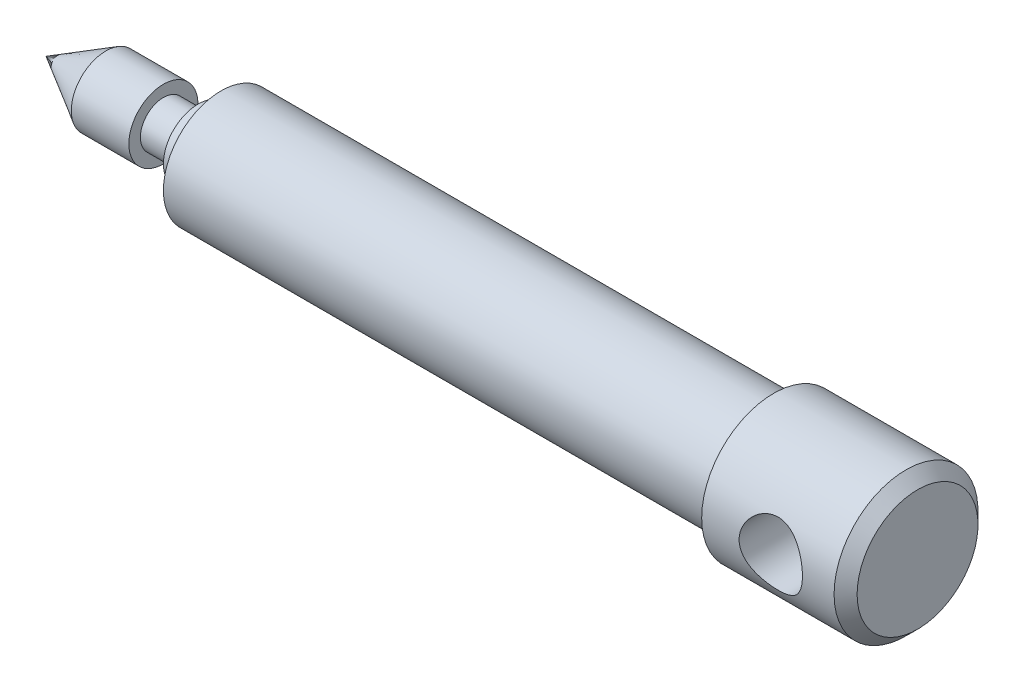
ISO-10303-21;
HEADER;
FILE_DESCRIPTION(('STEP AP214'),'2;1');
FILE_NAME('part.step','',(''),(''),'','','');
FILE_SCHEMA(('AUTOMOTIVE_DESIGN { 1 0 10303 214 1 1 1 1 }'));
ENDSEC;
DATA;
#1=APPLICATION_CONTEXT('core data for automotive mechanical design processes');
#2=APPLICATION_PROTOCOL_DEFINITION('international standard','automotive_design',2000,#1);
#3=PRODUCT_CONTEXT('',#1,'mechanical');
#4=PRODUCT('Part','Part','',(#3));
#5=PRODUCT_RELATED_PRODUCT_CATEGORY('part','',(#4));
#6=PRODUCT_DEFINITION_FORMATION('','',#4);
#7=PRODUCT_DEFINITION_CONTEXT('part definition',#1,'design');
#8=PRODUCT_DEFINITION('design','',#6,#7);
#9=PRODUCT_DEFINITION_SHAPE('','',#8);
#10=(LENGTH_UNIT() NAMED_UNIT(*) SI_UNIT(.MILLI.,.METRE.));
#11=(NAMED_UNIT(*) PLANE_ANGLE_UNIT() SI_UNIT($,.RADIAN.));
#12=(NAMED_UNIT(*) SI_UNIT($,.STERADIAN.) SOLID_ANGLE_UNIT());
#13=UNCERTAINTY_MEASURE_WITH_UNIT(LENGTH_MEASURE(1.E-05),#10,'distance_accuracy_value','');
#14=(GEOMETRIC_REPRESENTATION_CONTEXT(3) GLOBAL_UNCERTAINTY_ASSIGNED_CONTEXT((#13)) GLOBAL_UNIT_ASSIGNED_CONTEXT((#10,
#11,#12)) REPRESENTATION_CONTEXT('',''));
#15=CARTESIAN_POINT('',(0.,0.,0.));
#16=DIRECTION('',(0.,0.,1.));
#17=DIRECTION('',(1.,0.,0.));
#18=AXIS2_PLACEMENT_3D('',#15,#16,#17);
#19=CARTESIAN_POINT('',(151.392304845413,12.5,0.));
#20=DIRECTION('',(-1.,0.,0.));
#21=DIRECTION('',(0.,0.,1.));
#22=AXIS2_PLACEMENT_3D('',#19,#20,#21);
#23=PLANE('',#22);
#24=CARTESIAN_POINT('',(151.392304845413,0.,0.));
#25=DIRECTION('',(-1.,0.,0.));
#26=DIRECTION('',(0.,0.,1.));
#27=AXIS2_PLACEMENT_3D('',#24,#25,#26);
#28=CIRCLE('',#27,10.4999999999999);
#29=CARTESIAN_POINT('',(151.392304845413,0.,10.4999999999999));
#30=VERTEX_POINT('',#29);
#31=EDGE_CURVE('E11',#30,#30,#28,.F.);
#32=ORIENTED_EDGE('',*,*,#31,.T.);
#33=EDGE_LOOP('',(#32));
#34=FACE_BOUND('',#33,.T.);
#35=ADVANCED_FACE('F31',(#34),#23,.F.);
#36=CARTESIAN_POINT('',(0.,0.,0.));
#37=DIRECTION('',(-1.,0.,0.));
#38=DIRECTION('',(0.,0.,1.));
#39=AXIS2_PLACEMENT_3D('',#36,#37,#38);
#40=CYLINDRICAL_SURFACE('',#39,12.5);
#41=CARTESIAN_POINT('',(143.892304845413,0.,12.5));
#42=CARTESIAN_POINT('',(143.892303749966,-0.1466393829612,12.4999990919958));
#43=CARTESIAN_POINT('',(143.886432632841,-0.293318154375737,12.4974127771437));
#44=CARTESIAN_POINT('',(143.863005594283,-0.585621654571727,12.4871317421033));
#45=CARTESIAN_POINT('',(143.845442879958,-0.731245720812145,12.4794340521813));
#46=CARTESIAN_POINT('',(143.798776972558,-1.02057253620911,12.4591130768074));
#47=CARTESIAN_POINT('',(143.76965184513,-1.164271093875,12.4464804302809));
#48=CARTESIAN_POINT('',(143.700157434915,-1.44848793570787,12.4166145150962));
#49=CARTESIAN_POINT('',(143.65978355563,-1.58900489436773,12.3993793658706));
#50=CARTESIAN_POINT('',(143.568371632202,-1.8653196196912,12.3608234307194));
#51=CARTESIAN_POINT('',(143.517376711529,-2.00113395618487,12.3395191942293));
#52=CARTESIAN_POINT('',(143.405085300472,-2.26781794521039,12.2933054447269));
#53=CARTESIAN_POINT('',(143.343784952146,-2.39868572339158,12.268394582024));
#54=CARTESIAN_POINT('',(143.145224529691,-2.78254840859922,12.1891528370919));
#55=CARTESIAN_POINT('',(142.993187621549,-3.02715457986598,12.1302614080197));
#56=CARTESIAN_POINT('',(142.645568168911,-3.50004387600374,12.0026174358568));
#57=CARTESIAN_POINT('',(142.448188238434,-3.72689905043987,11.9335190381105));
#58=CARTESIAN_POINT('',(142.019057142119,-4.14565509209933,11.7945843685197));
#59=CARTESIAN_POINT('',(141.787286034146,-4.33753553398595,11.7247476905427));
#60=CARTESIAN_POINT('',(141.410808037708,-4.60042581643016,11.6230643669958));
#61=CARTESIAN_POINT('',(141.276540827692,-4.68578480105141,11.5888235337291));
#62=CARTESIAN_POINT('',(141.000597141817,-4.84480453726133,11.5232483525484));
#63=CARTESIAN_POINT('',(140.858923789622,-4.91847016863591,11.4919127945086));
#64=CARTESIAN_POINT('',(140.569026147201,-5.05346000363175,11.4331958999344));
#65=CARTESIAN_POINT('',(140.420801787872,-5.11478407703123,11.4058146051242));
#66=CARTESIAN_POINT('',(140.118886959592,-5.22443162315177,11.3560091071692));
#67=CARTESIAN_POINT('',(139.965199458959,-5.27276203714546,11.3335822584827));
#68=CARTESIAN_POINT('',(139.661503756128,-5.35374129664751,11.2955457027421));
#69=CARTESIAN_POINT('',(139.511713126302,-5.38706906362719,11.2796446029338));
#70=CARTESIAN_POINT('',(139.209441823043,-5.44112526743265,11.2536686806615));
#71=CARTESIAN_POINT('',(139.056962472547,-5.46185973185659,11.2435910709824));
#72=CARTESIAN_POINT('',(138.750569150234,-5.4904747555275,11.2296456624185));
#73=CARTESIAN_POINT('',(138.596655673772,-5.4983595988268,11.2257757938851));
#74=CARTESIAN_POINT('',(138.288686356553,-5.5011791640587,11.2243945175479));
#75=CARTESIAN_POINT('',(138.134630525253,-5.4961146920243,11.226882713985));
#76=CARTESIAN_POINT('',(137.841185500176,-5.474119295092,11.2376219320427));
#77=CARTESIAN_POINT('',(137.701694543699,-5.45826761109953,11.2453486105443));
#78=CARTESIAN_POINT('',(137.424642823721,-5.41602008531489,11.2657568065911));
#79=CARTESIAN_POINT('',(137.287082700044,-5.38962082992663,11.2784399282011));
#80=CARTESIAN_POINT('',(137.014871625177,-5.3265549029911,11.3083610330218));
#81=CARTESIAN_POINT('',(136.880220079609,-5.28989035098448,11.3255980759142));
#82=CARTESIAN_POINT('',(136.614592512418,-5.20664408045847,11.364108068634));
#83=CARTESIAN_POINT('',(136.483617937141,-5.16005851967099,11.3853825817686));
#84=CARTESIAN_POINT('',(136.091705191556,-5.0037345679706,11.4553883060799));
#85=CARTESIAN_POINT('',(135.837626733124,-4.87878948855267,11.5096215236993));
#86=CARTESIAN_POINT('',(135.353115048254,-4.59267512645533,11.6267428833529));
#87=CARTESIAN_POINT('',(135.122691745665,-4.43149073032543,11.6896346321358));
#88=CARTESIAN_POINT('',(134.668763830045,-4.05947526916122,11.8242722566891));
#89=CARTESIAN_POINT('',(134.448009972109,-3.84537725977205,11.8962908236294));
#90=CARTESIAN_POINT('',(134.04449070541,-3.38241134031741,12.0360945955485));
#91=CARTESIAN_POINT('',(133.861736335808,-3.13353336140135,12.1038785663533));
#92=CARTESIAN_POINT('',(133.617797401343,-2.73484422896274,12.197955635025));
#93=CARTESIAN_POINT('',(133.540649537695,-2.59555266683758,12.2284231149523));
#94=CARTESIAN_POINT('',(133.398467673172,-2.31018661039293,12.2855264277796));
#95=CARTESIAN_POINT('',(133.33342869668,-2.16411493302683,12.312163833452));
#96=CARTESIAN_POINT('',(133.216129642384,-1.8662354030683,12.3608229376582));
#97=CARTESIAN_POINT('',(133.163866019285,-1.71442915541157,12.3828459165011));
#98=CARTESIAN_POINT('',(133.072680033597,-1.40620435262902,12.4216223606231));
#99=CARTESIAN_POINT('',(133.033756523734,-1.24978619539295,12.4383762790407));
#100=CARTESIAN_POINT('',(132.971936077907,-0.944540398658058,12.4651385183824));
#101=CARTESIAN_POINT('',(132.948119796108,-0.795932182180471,12.4755320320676));
#102=CARTESIAN_POINT('',(132.912738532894,-0.496993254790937,12.4910124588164));
#103=CARTESIAN_POINT('',(132.901172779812,-0.346662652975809,12.4960997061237));
#104=CARTESIAN_POINT('',(132.890430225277,-0.045515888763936,12.500824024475));
#105=CARTESIAN_POINT('',(132.891250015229,0.105300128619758,12.5004625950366));
#106=CARTESIAN_POINT('',(132.905260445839,0.406241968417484,12.4943033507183));
#107=CARTESIAN_POINT('',(132.918450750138,0.556367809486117,12.4885056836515));
#108=CARTESIAN_POINT('',(132.955943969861,0.846230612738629,12.472119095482));
#109=CARTESIAN_POINT('',(132.979571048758,0.986072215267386,12.4618219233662));
#110=CARTESIAN_POINT('',(133.037454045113,1.26317698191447,12.4367900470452));
#111=CARTESIAN_POINT('',(133.071713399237,1.40043929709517,12.4220539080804));
#112=CARTESIAN_POINT('',(133.150526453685,1.67142388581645,12.3885014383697));
#113=CARTESIAN_POINT('',(133.195077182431,1.80514716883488,12.3696862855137));
#114=CARTESIAN_POINT('',(133.294082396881,2.068314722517,12.3284167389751));
#115=CARTESIAN_POINT('',(133.348540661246,2.19775733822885,12.3059609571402));
#116=CARTESIAN_POINT('',(133.529807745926,2.5863761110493,12.232388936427));
#117=CARTESIAN_POINT('',(133.672100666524,2.83756706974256,12.1761319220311));
#118=CARTESIAN_POINT('',(133.992912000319,3.31328248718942,12.0553981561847));
#119=CARTESIAN_POINT('',(134.171446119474,3.53779531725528,11.9909178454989));
#120=CARTESIAN_POINT('',(134.576152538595,3.97266163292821,11.8542772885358));
#121=CARTESIAN_POINT('',(134.804976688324,4.18048852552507,11.7819130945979));
#122=CARTESIAN_POINT('',(135.295366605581,4.55567668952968,11.6419938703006));
#123=CARTESIAN_POINT('',(135.556943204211,4.72302452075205,11.5744404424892));
#124=CARTESIAN_POINT('',(135.972184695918,4.94148703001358,11.4820792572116));
#125=CARTESIAN_POINT('',(136.116153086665,5.009449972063,11.4525092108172));
#126=CARTESIAN_POINT('',(136.410131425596,5.13287060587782,11.3977278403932));
#127=CARTESIAN_POINT('',(136.560138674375,5.18833381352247,11.372514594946));
#128=CARTESIAN_POINT('',(136.865054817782,5.28612668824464,11.3273901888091));
#129=CARTESIAN_POINT('',(137.019960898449,5.32846374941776,11.3074760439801));
#130=CARTESIAN_POINT('',(137.333515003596,5.39951781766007,11.2737199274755));
#131=CARTESIAN_POINT('',(137.492162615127,5.42823632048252,11.2598772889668));
#132=CARTESIAN_POINT('',(137.798425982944,5.46984065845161,11.2397209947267));
#133=CARTESIAN_POINT('',(137.945855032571,5.48384952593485,11.232874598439));
#134=CARTESIAN_POINT('',(138.241514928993,5.49992508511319,11.2250125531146));
#135=CARTESIAN_POINT('',(138.389745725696,5.50199251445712,11.2239965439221));
#136=CARTESIAN_POINT('',(138.685786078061,5.4941597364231,11.227832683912));
#137=CARTESIAN_POINT('',(138.833595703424,5.48426164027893,11.2326837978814));
#138=CARTESIAN_POINT('',(139.127637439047,5.45262810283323,11.2480733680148));
#139=CARTESIAN_POINT('',(139.273869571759,5.43089283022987,11.2586117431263));
#140=CARTESIAN_POINT('',(139.555221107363,5.37744521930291,11.2842326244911));
#141=CARTESIAN_POINT('',(139.690492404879,5.34638619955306,11.2990154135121));
#142=CARTESIAN_POINT('',(139.957823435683,5.27430996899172,11.3328385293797));
#143=CARTESIAN_POINT('',(140.089882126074,5.23328957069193,11.3518802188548));
#144=CARTESIAN_POINT('',(140.480034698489,5.09581073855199,11.4145927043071));
#145=CARTESIAN_POINT('',(140.732295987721,4.98489791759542,11.4638695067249));
#146=CARTESIAN_POINT('',(141.231071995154,4.71978063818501,11.5756461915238));
#147=CARTESIAN_POINT('',(141.47620344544,4.56327347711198,11.6387872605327));
#148=CARTESIAN_POINT('',(141.93825431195,4.21426117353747,11.7696489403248));
#149=CARTESIAN_POINT('',(142.155162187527,4.02174138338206,11.83737140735));
#150=CARTESIAN_POINT('',(142.46449244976,3.70026878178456,11.9403590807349));
#151=CARTESIAN_POINT('',(142.568510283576,3.58246341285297,11.9763161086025));
#152=CARTESIAN_POINT('',(142.766275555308,3.33812094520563,12.046704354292));
#153=CARTESIAN_POINT('',(142.860026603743,3.2115869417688,12.0811361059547));
#154=CARTESIAN_POINT('',(143.036673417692,2.9503778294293,12.1475698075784));
#155=CARTESIAN_POINT('',(143.119559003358,2.81569525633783,12.1795694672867));
#156=CARTESIAN_POINT('',(143.273665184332,2.53916491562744,12.2402067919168));
#157=CARTESIAN_POINT('',(143.344891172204,2.39732050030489,12.2688460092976));
#158=CARTESIAN_POINT('',(143.47428893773,2.10905276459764,12.3216522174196));
#159=CARTESIAN_POINT('',(143.532604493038,1.96270298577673,12.3458678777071));
#160=CARTESIAN_POINT('',(143.636611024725,1.66496318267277,12.3895326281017));
#161=CARTESIAN_POINT('',(143.682308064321,1.51357561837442,12.4089840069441));
#162=CARTESIAN_POINT('',(143.760497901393,1.20724269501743,12.4425179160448));
#163=CARTESIAN_POINT('',(143.793022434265,1.05230684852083,12.4566133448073));
#164=CARTESIAN_POINT('',(143.844608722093,0.73987760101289,12.47906540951));
#165=CARTESIAN_POINT('',(143.863679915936,0.582386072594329,12.4874260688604));
#166=CARTESIAN_POINT('',(143.881373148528,0.353758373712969,12.4951932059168));
#167=CARTESIAN_POINT('',(143.885471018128,0.283084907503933,12.4969943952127));
#168=CARTESIAN_POINT('',(143.890937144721,0.14161068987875,12.4993980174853));
#169=CARTESIAN_POINT('',(143.892305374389,0.0708099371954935,12.5000004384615));
#170=CARTESIAN_POINT('',(143.892304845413,0.,12.5));
#171=B_SPLINE_CURVE_WITH_KNOTS('',3,(#41,#42,#43,#44,#45,#46,#47,#48,#49,#50,#51,#52,#53,#54,
#55,#56,#57,#58,#59,#60,#61,#62,#63,#64,#65,#66,#67,#68,#69,#70,#71,#72,#73,#74,#75,#76,#77,#78,
#79,#80,#81,#82,#83,#84,#85,#86,#87,#88,#89,#90,#91,#92,#93,#94,#95,#96,#97,#98,#99,#100,#101,
#102,#103,#104,#105,#106,#107,#108,#109,#110,#111,#112,#113,#114,#115,#116,#117,#118,#119,#120,
#121,#122,#123,#124,#125,#126,#127,#128,#129,#130,#131,#132,#133,#134,#135,#136,#137,#138,#139,
#140,#141,#142,#143,#144,#145,#146,#147,#148,#149,#150,#151,#152,#153,#154,#155,#156,#157,#158,
#159,#160,#161,#162,#163,#164,#165,#166,#167,#168,#169,#170),.UNSPECIFIED.,.T.,.F.,(4,2,2,2,2,2,
2,2,2,2,2,2,2,2,2,2,2,2,2,2,2,2,2,2,2,2,2,2,2,2,2,2,2,2,2,2,2,2,2,2,2,2,2,2,2,2,2,2,2,2,2,2,2,2,
2,2,2,2,2,2,2,2,2,2,4),(0.,0.439846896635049,0.879949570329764,1.32089115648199,
1.76201318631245,2.20137792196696,2.64090750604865,3.51885611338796,4.44070823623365,
5.36309701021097,5.85082579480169,6.33835050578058,6.82588036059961,7.31314925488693,
7.77534632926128,8.23732200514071,8.69914362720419,9.16093650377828,9.58224460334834,
10.0036891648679,10.4250467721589,10.846567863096,11.7075328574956,12.568857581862,
13.5122441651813,14.4559044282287,14.9417259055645,15.4273473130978,15.9128338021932,
16.3982785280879,16.8502809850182,17.3022549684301,17.7541045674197,18.2059418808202,
18.632040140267,19.0582762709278,19.4843894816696,19.9106655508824,20.7889739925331,
21.6676638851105,22.6158909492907,23.5644324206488,24.0496707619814,24.5346945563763,
25.0194446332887,25.5041414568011,25.9483117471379,26.3924545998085,26.8365190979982,
27.2805772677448,27.6988256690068,28.1172080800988,28.9533936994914,29.8427032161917,
30.7323752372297,31.2155464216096,31.6985471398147,32.181997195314,32.6652230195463,
33.1427614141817,33.6200699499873,34.0962216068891,34.5720388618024,34.7844321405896,
34.9968275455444),.UNSPECIFIED.);
#172=CARTESIAN_POINT('',(143.892304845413,0.,12.5));
#173=VERTEX_POINT('',#172);
#174=EDGE_CURVE('E35',#173,#173,#171,.T.);
#175=ORIENTED_EDGE('',*,*,#174,.T.);
#176=EDGE_LOOP('',(#175));
#177=FACE_BOUND('',#176,.T.);
#178=CARTESIAN_POINT('',(143.892304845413,0.,-12.5));
#179=CARTESIAN_POINT('',(143.892303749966,0.1466393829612,-12.4999990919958));
#180=CARTESIAN_POINT('',(143.886432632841,0.293318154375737,-12.4974127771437));
#181=CARTESIAN_POINT('',(143.863005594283,0.585621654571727,-12.4871317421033));
#182=CARTESIAN_POINT('',(143.845442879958,0.731245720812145,-12.4794340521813));
#183=CARTESIAN_POINT('',(143.798776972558,1.02057253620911,-12.4591130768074));
#184=CARTESIAN_POINT('',(143.76965184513,1.164271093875,-12.4464804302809));
#185=CARTESIAN_POINT('',(143.700157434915,1.44848793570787,-12.4166145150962));
#186=CARTESIAN_POINT('',(143.65978355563,1.58900489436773,-12.3993793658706));
#187=CARTESIAN_POINT('',(143.568371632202,1.8653196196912,-12.3608234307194));
#188=CARTESIAN_POINT('',(143.517376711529,2.00113395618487,-12.3395191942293));
#189=CARTESIAN_POINT('',(143.405085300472,2.26781794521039,-12.2933054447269));
#190=CARTESIAN_POINT('',(143.343784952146,2.39868572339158,-12.268394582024));
#191=CARTESIAN_POINT('',(143.145224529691,2.78254840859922,-12.1891528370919));
#192=CARTESIAN_POINT('',(142.993187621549,3.02715457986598,-12.1302614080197));
#193=CARTESIAN_POINT('',(142.645568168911,3.50004387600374,-12.0026174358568));
#194=CARTESIAN_POINT('',(142.448188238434,3.72689905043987,-11.9335190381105));
#195=CARTESIAN_POINT('',(142.019057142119,4.14565509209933,-11.7945843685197));
#196=CARTESIAN_POINT('',(141.787286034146,4.33753553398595,-11.7247476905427));
#197=CARTESIAN_POINT('',(141.410808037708,4.60042581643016,-11.6230643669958));
#198=CARTESIAN_POINT('',(141.276540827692,4.68578480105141,-11.5888235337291));
#199=CARTESIAN_POINT('',(141.000597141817,4.84480453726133,-11.5232483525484));
#200=CARTESIAN_POINT('',(140.858923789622,4.91847016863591,-11.4919127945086));
#201=CARTESIAN_POINT('',(140.569026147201,5.05346000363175,-11.4331958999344));
#202=CARTESIAN_POINT('',(140.420801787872,5.11478407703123,-11.4058146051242));
#203=CARTESIAN_POINT('',(140.118886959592,5.22443162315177,-11.3560091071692));
#204=CARTESIAN_POINT('',(139.965199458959,5.27276203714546,-11.3335822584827));
#205=CARTESIAN_POINT('',(139.661503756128,5.35374129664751,-11.2955457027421));
#206=CARTESIAN_POINT('',(139.511713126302,5.38706906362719,-11.2796446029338));
#207=CARTESIAN_POINT('',(139.209441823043,5.44112526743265,-11.2536686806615));
#208=CARTESIAN_POINT('',(139.056962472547,5.46185973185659,-11.2435910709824));
#209=CARTESIAN_POINT('',(138.750569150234,5.4904747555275,-11.2296456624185));
#210=CARTESIAN_POINT('',(138.596655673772,5.4983595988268,-11.2257757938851));
#211=CARTESIAN_POINT('',(138.288686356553,5.5011791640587,-11.2243945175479));
#212=CARTESIAN_POINT('',(138.134630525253,5.4961146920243,-11.226882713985));
#213=CARTESIAN_POINT('',(137.841185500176,5.474119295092,-11.2376219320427));
#214=CARTESIAN_POINT('',(137.701694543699,5.45826761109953,-11.2453486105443));
#215=CARTESIAN_POINT('',(137.424642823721,5.41602008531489,-11.2657568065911));
#216=CARTESIAN_POINT('',(137.287082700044,5.38962082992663,-11.2784399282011));
#217=CARTESIAN_POINT('',(137.014871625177,5.3265549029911,-11.3083610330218));
#218=CARTESIAN_POINT('',(136.880220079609,5.28989035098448,-11.3255980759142));
#219=CARTESIAN_POINT('',(136.614592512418,5.20664408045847,-11.364108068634));
#220=CARTESIAN_POINT('',(136.483617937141,5.16005851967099,-11.3853825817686));
#221=CARTESIAN_POINT('',(136.091705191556,5.0037345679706,-11.4553883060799));
#222=CARTESIAN_POINT('',(135.837626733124,4.87878948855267,-11.5096215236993));
#223=CARTESIAN_POINT('',(135.353115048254,4.59267512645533,-11.6267428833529));
#224=CARTESIAN_POINT('',(135.122691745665,4.43149073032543,-11.6896346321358));
#225=CARTESIAN_POINT('',(134.668763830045,4.05947526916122,-11.8242722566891));
#226=CARTESIAN_POINT('',(134.448009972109,3.84537725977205,-11.8962908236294));
#227=CARTESIAN_POINT('',(134.04449070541,3.38241134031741,-12.0360945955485));
#228=CARTESIAN_POINT('',(133.861736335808,3.13353336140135,-12.1038785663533));
#229=CARTESIAN_POINT('',(133.617797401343,2.73484422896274,-12.197955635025));
#230=CARTESIAN_POINT('',(133.540649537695,2.59555266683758,-12.2284231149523));
#231=CARTESIAN_POINT('',(133.398467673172,2.31018661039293,-12.2855264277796));
#232=CARTESIAN_POINT('',(133.33342869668,2.16411493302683,-12.312163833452));
#233=CARTESIAN_POINT('',(133.216129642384,1.8662354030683,-12.3608229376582));
#234=CARTESIAN_POINT('',(133.163866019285,1.71442915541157,-12.3828459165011));
#235=CARTESIAN_POINT('',(133.072680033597,1.40620435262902,-12.4216223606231));
#236=CARTESIAN_POINT('',(133.033756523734,1.24978619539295,-12.4383762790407));
#237=CARTESIAN_POINT('',(132.971936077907,0.944540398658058,-12.4651385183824));
#238=CARTESIAN_POINT('',(132.948119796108,0.795932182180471,-12.4755320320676));
#239=CARTESIAN_POINT('',(132.912738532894,0.496993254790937,-12.4910124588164));
#240=CARTESIAN_POINT('',(132.901172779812,0.346662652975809,-12.4960997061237));
#241=CARTESIAN_POINT('',(132.890430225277,0.045515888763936,-12.500824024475));
#242=CARTESIAN_POINT('',(132.891250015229,-0.105300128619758,-12.5004625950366));
#243=CARTESIAN_POINT('',(132.905260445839,-0.406241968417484,-12.4943033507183));
#244=CARTESIAN_POINT('',(132.918450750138,-0.556367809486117,-12.4885056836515));
#245=CARTESIAN_POINT('',(132.955943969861,-0.846230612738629,-12.472119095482));
#246=CARTESIAN_POINT('',(132.979571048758,-0.986072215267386,-12.4618219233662));
#247=CARTESIAN_POINT('',(133.037454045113,-1.26317698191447,-12.4367900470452));
#248=CARTESIAN_POINT('',(133.071713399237,-1.40043929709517,-12.4220539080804));
#249=CARTESIAN_POINT('',(133.150526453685,-1.67142388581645,-12.3885014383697));
#250=CARTESIAN_POINT('',(133.195077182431,-1.80514716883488,-12.3696862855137));
#251=CARTESIAN_POINT('',(133.294082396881,-2.068314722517,-12.3284167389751));
#252=CARTESIAN_POINT('',(133.348540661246,-2.19775733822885,-12.3059609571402));
#253=CARTESIAN_POINT('',(133.529807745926,-2.5863761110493,-12.232388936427));
#254=CARTESIAN_POINT('',(133.672100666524,-2.83756706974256,-12.1761319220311));
#255=CARTESIAN_POINT('',(133.992912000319,-3.31328248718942,-12.0553981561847));
#256=CARTESIAN_POINT('',(134.171446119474,-3.53779531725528,-11.9909178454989));
#257=CARTESIAN_POINT('',(134.576152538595,-3.97266163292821,-11.8542772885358));
#258=CARTESIAN_POINT('',(134.804976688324,-4.18048852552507,-11.7819130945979));
#259=CARTESIAN_POINT('',(135.295366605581,-4.55567668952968,-11.6419938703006));
#260=CARTESIAN_POINT('',(135.556943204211,-4.72302452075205,-11.5744404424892));
#261=CARTESIAN_POINT('',(135.972184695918,-4.94148703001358,-11.4820792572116));
#262=CARTESIAN_POINT('',(136.116153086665,-5.009449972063,-11.4525092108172));
#263=CARTESIAN_POINT('',(136.410131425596,-5.13287060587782,-11.3977278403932));
#264=CARTESIAN_POINT('',(136.560138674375,-5.18833381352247,-11.372514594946));
#265=CARTESIAN_POINT('',(136.865054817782,-5.28612668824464,-11.3273901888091));
#266=CARTESIAN_POINT('',(137.019960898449,-5.32846374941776,-11.3074760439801));
#267=CARTESIAN_POINT('',(137.333515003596,-5.39951781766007,-11.2737199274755));
#268=CARTESIAN_POINT('',(137.492162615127,-5.42823632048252,-11.2598772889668));
#269=CARTESIAN_POINT('',(137.798425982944,-5.46984065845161,-11.2397209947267));
#270=CARTESIAN_POINT('',(137.945855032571,-5.48384952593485,-11.232874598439));
#271=CARTESIAN_POINT('',(138.241514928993,-5.49992508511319,-11.2250125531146));
#272=CARTESIAN_POINT('',(138.389745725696,-5.50199251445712,-11.2239965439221));
#273=CARTESIAN_POINT('',(138.685786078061,-5.4941597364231,-11.227832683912));
#274=CARTESIAN_POINT('',(138.833595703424,-5.48426164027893,-11.2326837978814));
#275=CARTESIAN_POINT('',(139.127637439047,-5.45262810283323,-11.2480733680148));
#276=CARTESIAN_POINT('',(139.273869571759,-5.43089283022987,-11.2586117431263));
#277=CARTESIAN_POINT('',(139.555221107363,-5.37744521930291,-11.2842326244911));
#278=CARTESIAN_POINT('',(139.690492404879,-5.34638619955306,-11.2990154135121));
#279=CARTESIAN_POINT('',(139.957823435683,-5.27430996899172,-11.3328385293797));
#280=CARTESIAN_POINT('',(140.089882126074,-5.23328957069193,-11.3518802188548));
#281=CARTESIAN_POINT('',(140.480034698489,-5.09581073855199,-11.4145927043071));
#282=CARTESIAN_POINT('',(140.732295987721,-4.98489791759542,-11.4638695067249));
#283=CARTESIAN_POINT('',(141.231071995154,-4.71978063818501,-11.5756461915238));
#284=CARTESIAN_POINT('',(141.47620344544,-4.56327347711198,-11.6387872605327));
#285=CARTESIAN_POINT('',(141.93825431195,-4.21426117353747,-11.7696489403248));
#286=CARTESIAN_POINT('',(142.155162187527,-4.02174138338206,-11.83737140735));
#287=CARTESIAN_POINT('',(142.46449244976,-3.70026878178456,-11.9403590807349));
#288=CARTESIAN_POINT('',(142.568510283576,-3.58246341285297,-11.9763161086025));
#289=CARTESIAN_POINT('',(142.766275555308,-3.33812094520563,-12.046704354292));
#290=CARTESIAN_POINT('',(142.860026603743,-3.2115869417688,-12.0811361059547));
#291=CARTESIAN_POINT('',(143.036673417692,-2.9503778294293,-12.1475698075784));
#292=CARTESIAN_POINT('',(143.119559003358,-2.81569525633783,-12.1795694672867));
#293=CARTESIAN_POINT('',(143.273665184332,-2.53916491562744,-12.2402067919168));
#294=CARTESIAN_POINT('',(143.344891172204,-2.39732050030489,-12.2688460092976));
#295=CARTESIAN_POINT('',(143.47428893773,-2.10905276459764,-12.3216522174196));
#296=CARTESIAN_POINT('',(143.532604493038,-1.96270298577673,-12.3458678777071));
#297=CARTESIAN_POINT('',(143.636611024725,-1.66496318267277,-12.3895326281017));
#298=CARTESIAN_POINT('',(143.682308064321,-1.51357561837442,-12.4089840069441));
#299=CARTESIAN_POINT('',(143.760497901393,-1.20724269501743,-12.4425179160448));
#300=CARTESIAN_POINT('',(143.793022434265,-1.05230684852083,-12.4566133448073));
#301=CARTESIAN_POINT('',(143.844608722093,-0.73987760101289,-12.47906540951));
#302=CARTESIAN_POINT('',(143.863679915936,-0.582386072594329,-12.4874260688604));
#303=CARTESIAN_POINT('',(143.881373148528,-0.353758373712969,-12.4951932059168));
#304=CARTESIAN_POINT('',(143.885471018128,-0.283084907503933,-12.4969943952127));
#305=CARTESIAN_POINT('',(143.890937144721,-0.14161068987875,-12.4993980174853));
#306=CARTESIAN_POINT('',(143.892305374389,-0.0708099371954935,-12.5000004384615));
#307=CARTESIAN_POINT('',(143.892304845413,0.,-12.5));
#308=B_SPLINE_CURVE_WITH_KNOTS('',3,(#178,#179,#180,#181,#182,#183,#184,#185,#186,#187,#188,
#189,#190,#191,#192,#193,#194,#195,#196,#197,#198,#199,#200,#201,#202,#203,#204,#205,#206,#207,
#208,#209,#210,#211,#212,#213,#214,#215,#216,#217,#218,#219,#220,#221,#222,#223,#224,#225,#226,
#227,#228,#229,#230,#231,#232,#233,#234,#235,#236,#237,#238,#239,#240,#241,#242,#243,#244,#245,
#246,#247,#248,#249,#250,#251,#252,#253,#254,#255,#256,#257,#258,#259,#260,#261,#262,#263,#264,
#265,#266,#267,#268,#269,#270,#271,#272,#273,#274,#275,#276,#277,#278,#279,#280,#281,#282,#283,
#284,#285,#286,#287,#288,#289,#290,#291,#292,#293,#294,#295,#296,#297,#298,#299,#300,#301,#302,
#303,#304,#305,#306,#307),.UNSPECIFIED.,.T.,.F.,(4,2,2,2,2,2,2,2,2,2,2,2,2,2,2,2,2,2,2,2,2,2,2,
2,2,2,2,2,2,2,2,2,2,2,2,2,2,2,2,2,2,2,2,2,2,2,2,2,2,2,2,2,2,2,2,2,2,2,2,2,2,2,2,2,4),(0.,
0.439846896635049,0.879949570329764,1.32089115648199,1.76201318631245,2.20137792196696,
2.64090750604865,3.51885611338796,4.44070823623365,5.36309701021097,5.85082579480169,
6.33835050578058,6.82588036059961,7.31314925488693,7.77534632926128,8.23732200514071,
8.69914362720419,9.16093650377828,9.58224460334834,10.0036891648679,10.4250467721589,
10.846567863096,11.7075328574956,12.568857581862,13.5122441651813,14.4559044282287,
14.9417259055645,15.4273473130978,15.9128338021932,16.3982785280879,16.8502809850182,
17.3022549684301,17.7541045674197,18.2059418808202,18.632040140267,19.0582762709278,
19.4843894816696,19.9106655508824,20.7889739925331,21.6676638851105,22.6158909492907,
23.5644324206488,24.0496707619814,24.5346945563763,25.0194446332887,25.5041414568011,
25.9483117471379,26.3924545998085,26.8365190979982,27.2805772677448,27.6988256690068,
28.1172080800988,28.9533936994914,29.8427032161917,30.7323752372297,31.2155464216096,
31.6985471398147,32.181997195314,32.6652230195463,33.1427614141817,33.6200699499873,
34.0962216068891,34.5720388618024,34.7844321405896,34.9968275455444),.UNSPECIFIED.);
#309=CARTESIAN_POINT('',(143.892304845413,0.,-12.5));
#310=VERTEX_POINT('',#309);
#311=EDGE_CURVE('E62',#310,#310,#308,.T.);
#312=ORIENTED_EDGE('',*,*,#311,.T.);
#313=EDGE_LOOP('',(#312));
#314=FACE_BOUND('',#313,.T.);
#315=CARTESIAN_POINT('',(149.392304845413,0.,0.));
#316=DIRECTION('',(-1.,0.,0.));
#317=DIRECTION('',(0.,0.,1.));
#318=AXIS2_PLACEMENT_3D('',#315,#316,#317);
#319=CIRCLE('',#318,12.5);
#320=CARTESIAN_POINT('',(149.392304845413,0.,12.5));
#321=VERTEX_POINT('',#320);
#322=EDGE_CURVE('E43',#321,#321,#319,.T.);
#323=ORIENTED_EDGE('',*,*,#322,.T.);
#324=EDGE_LOOP('',(#323));
#325=FACE_BOUND('',#324,.T.);
#326=CARTESIAN_POINT('',(126.392304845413,0.,0.));
#327=DIRECTION('',(-1.,0.,0.));
#328=DIRECTION('',(0.,0.,1.));
#329=AXIS2_PLACEMENT_3D('',#326,#327,#328);
#330=CIRCLE('',#329,12.5);
#331=CARTESIAN_POINT('',(126.392304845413,0.,12.5));
#332=VERTEX_POINT('',#331);
#333=EDGE_CURVE('E81',#332,#332,#330,.T.);
#334=ORIENTED_EDGE('',*,*,#333,.F.);
#335=EDGE_LOOP('',(#334));
#336=FACE_BOUND('',#335,.T.);
#337=ADVANCED_FACE('F88',(#177,#314,#325,#336),#40,.T.);
#338=CARTESIAN_POINT('',(126.392304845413,10.,0.));
#339=DIRECTION('',(1.,0.,0.));
#340=DIRECTION('',(0.,0.,-1.));
#341=AXIS2_PLACEMENT_3D('',#338,#339,#340);
#342=PLANE('',#341);
#343=CARTESIAN_POINT('',(126.392304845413,0.,0.));
#344=DIRECTION('',(-1.,0.,0.));
#345=DIRECTION('',(0.,0.,1.));
#346=AXIS2_PLACEMENT_3D('',#343,#344,#345);
#347=CIRCLE('',#346,10.);
#348=CARTESIAN_POINT('',(126.392304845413,0.,10.));
#349=VERTEX_POINT('',#348);
#350=EDGE_CURVE('E78',#349,#349,#347,.T.);
#351=ORIENTED_EDGE('',*,*,#350,.F.);
#352=EDGE_LOOP('',(#351));
#353=FACE_BOUND('',#352,.T.);
#354=ORIENTED_EDGE('',*,*,#333,.T.);
#355=EDGE_LOOP('',(#354));
#356=FACE_BOUND('',#355,.T.);
#357=ADVANCED_FACE('F121',(#353,#356),#342,.F.);
#358=CARTESIAN_POINT('',(0.,0.,0.));
#359=DIRECTION('',(-1.,0.,0.));
#360=DIRECTION('',(0.,0.,1.));
#361=AXIS2_PLACEMENT_3D('',#358,#359,#360);
#362=CYLINDRICAL_SURFACE('',#361,10.);
#363=CARTESIAN_POINT('',(30.3923048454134,0.,0.));
#364=DIRECTION('',(-1.,0.,0.));
#365=DIRECTION('',(0.,0.,1.));
#366=AXIS2_PLACEMENT_3D('',#363,#364,#365);
#367=CIRCLE('',#366,10.);
#368=CARTESIAN_POINT('',(30.3923048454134,0.,10.));
#369=VERTEX_POINT('',#368);
#370=EDGE_CURVE('E75',#369,#369,#367,.T.);
#371=ORIENTED_EDGE('',*,*,#370,.F.);
#372=EDGE_LOOP('',(#371));
#373=FACE_BOUND('',#372,.T.);
#374=ORIENTED_EDGE('',*,*,#350,.T.);
#375=EDGE_LOOP('',(#374));
#376=FACE_BOUND('',#375,.T.);
#377=ADVANCED_FACE('F118',(#373,#376),#362,.T.);
#378=CARTESIAN_POINT('',(30.3923048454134,6.,0.));
#379=DIRECTION('',(1.,0.,0.));
#380=DIRECTION('',(0.,0.,-1.));
#381=AXIS2_PLACEMENT_3D('',#378,#379,#380);
#382=PLANE('',#381);
#383=CARTESIAN_POINT('',(30.3923048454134,0.,0.));
#384=DIRECTION('',(-1.,0.,0.));
#385=DIRECTION('',(0.,0.,1.));
#386=AXIS2_PLACEMENT_3D('',#383,#384,#385);
#387=CIRCLE('',#386,6.);
#388=CARTESIAN_POINT('',(30.3923048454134,0.,6.));
#389=VERTEX_POINT('',#388);
#390=EDGE_CURVE('E72',#389,#389,#387,.T.);
#391=ORIENTED_EDGE('',*,*,#390,.F.);
#392=EDGE_LOOP('',(#391));
#393=FACE_BOUND('',#392,.T.);
#394=ORIENTED_EDGE('',*,*,#370,.T.);
#395=EDGE_LOOP('',(#394));
#396=FACE_BOUND('',#395,.T.);
#397=ADVANCED_FACE('F114',(#393,#396),#382,.F.);
#398=CARTESIAN_POINT('',(0.,0.,0.));
#399=DIRECTION('',(-1.,0.,0.));
#400=DIRECTION('',(0.,0.,1.));
#401=AXIS2_PLACEMENT_3D('',#398,#399,#400);
#402=CYLINDRICAL_SURFACE('',#401,6.);
#403=CARTESIAN_POINT('',(26.3923048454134,0.,0.));
#404=DIRECTION('',(-1.,0.,0.));
#405=DIRECTION('',(0.,0.,1.));
#406=AXIS2_PLACEMENT_3D('',#403,#404,#405);
#407=CIRCLE('',#406,6.);
#408=CARTESIAN_POINT('',(26.3923048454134,0.,6.));
#409=VERTEX_POINT('',#408);
#410=EDGE_CURVE('E69',#409,#409,#407,.T.);
#411=ORIENTED_EDGE('',*,*,#410,.F.);
#412=EDGE_LOOP('',(#411));
#413=FACE_BOUND('',#412,.T.);
#414=ORIENTED_EDGE('',*,*,#390,.T.);
#415=EDGE_LOOP('',(#414));
#416=FACE_BOUND('',#415,.T.);
#417=ADVANCED_FACE('F110',(#413,#416),#402,.T.);
#418=CARTESIAN_POINT('',(26.3923048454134,4.,0.));
#419=DIRECTION('',(1.,0.,0.));
#420=DIRECTION('',(0.,0.,-1.));
#421=AXIS2_PLACEMENT_3D('',#418,#419,#420);
#422=PLANE('',#421);
#423=CARTESIAN_POINT('',(26.3923048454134,0.,0.));
#424=DIRECTION('',(-1.,0.,0.));
#425=DIRECTION('',(0.,0.,1.));
#426=AXIS2_PLACEMENT_3D('',#423,#424,#425);
#427=CIRCLE('',#426,4.);
#428=CARTESIAN_POINT('',(26.3923048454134,0.,4.));
#429=VERTEX_POINT('',#428);
#430=EDGE_CURVE('E66',#429,#429,#427,.T.);
#431=ORIENTED_EDGE('',*,*,#430,.F.);
#432=EDGE_LOOP('',(#431));
#433=FACE_BOUND('',#432,.T.);
#434=ORIENTED_EDGE('',*,*,#410,.T.);
#435=EDGE_LOOP('',(#434));
#436=FACE_BOUND('',#435,.T.);
#437=ADVANCED_FACE('F106',(#433,#436),#422,.F.);
#438=CARTESIAN_POINT('',(0.,0.,0.));
#439=DIRECTION('',(-1.,0.,0.));
#440=DIRECTION('',(0.,0.,1.));
#441=AXIS2_PLACEMENT_3D('',#438,#439,#440);
#442=CYLINDRICAL_SURFACE('',#441,4.);
#443=CARTESIAN_POINT('',(20.3923048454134,0.,0.));
#444=DIRECTION('',(-1.,0.,0.));
#445=DIRECTION('',(0.,0.,1.));
#446=AXIS2_PLACEMENT_3D('',#443,#444,#445);
#447=CIRCLE('',#446,4.);
#448=CARTESIAN_POINT('',(20.3923048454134,0.,4.));
#449=VERTEX_POINT('',#448);
#450=EDGE_CURVE('E59',#449,#449,#447,.T.);
#451=ORIENTED_EDGE('',*,*,#450,.F.);
#452=EDGE_LOOP('',(#451));
#453=FACE_BOUND('',#452,.T.);
#454=ORIENTED_EDGE('',*,*,#430,.T.);
#455=EDGE_LOOP('',(#454));
#456=FACE_BOUND('',#455,.T.);
#457=ADVANCED_FACE('F102',(#453,#456),#442,.T.);
#458=CARTESIAN_POINT('',(20.3923048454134,6.,0.));
#459=DIRECTION('',(-1.,0.,0.));
#460=DIRECTION('',(0.,0.,1.));
#461=AXIS2_PLACEMENT_3D('',#458,#459,#460);
#462=PLANE('',#461);
#463=CARTESIAN_POINT('',(20.3923048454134,0.,0.));
#464=DIRECTION('',(-1.,0.,0.));
#465=DIRECTION('',(0.,0.,1.));
#466=AXIS2_PLACEMENT_3D('',#463,#464,#465);
#467=CIRCLE('',#466,6.);
#468=CARTESIAN_POINT('',(20.3923048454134,0.,6.));
#469=VERTEX_POINT('',#468);
#470=EDGE_CURVE('E56',#469,#469,#467,.T.);
#471=ORIENTED_EDGE('',*,*,#470,.F.);
#472=EDGE_LOOP('',(#471));
#473=FACE_BOUND('',#472,.T.);
#474=ORIENTED_EDGE('',*,*,#450,.T.);
#475=EDGE_LOOP('',(#474));
#476=FACE_BOUND('',#475,.T.);
#477=ADVANCED_FACE('F99',(#473,#476),#462,.F.);
#478=CARTESIAN_POINT('',(0.,0.,0.));
#479=DIRECTION('',(-1.,0.,0.));
#480=DIRECTION('',(0.,0.,1.));
#481=AXIS2_PLACEMENT_3D('',#478,#479,#480);
#482=CYLINDRICAL_SURFACE('',#481,6.);
#483=CARTESIAN_POINT('',(10.3923048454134,0.,0.));
#484=DIRECTION('',(-1.,0.,0.));
#485=DIRECTION('',(0.,0.,1.));
#486=AXIS2_PLACEMENT_3D('',#483,#484,#485);
#487=CIRCLE('',#486,6.);
#488=CARTESIAN_POINT('',(10.3923048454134,0.,6.));
#489=VERTEX_POINT('',#488);
#490=EDGE_CURVE('E54',#489,#489,#487,.T.);
#491=ORIENTED_EDGE('',*,*,#490,.F.);
#492=EDGE_LOOP('',(#491));
#493=FACE_BOUND('',#492,.T.);
#494=ORIENTED_EDGE('',*,*,#470,.T.);
#495=EDGE_LOOP('',(#494));
#496=FACE_BOUND('',#495,.T.);
#497=ADVANCED_FACE('F50',(#493,#496),#482,.T.);
#498=CARTESIAN_POINT('',(10.3923048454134,0.,0.));
#499=DIRECTION('',(1.,0.,0.));
#500=DIRECTION('',(0.,0.,-1.));
#501=AXIS2_PLACEMENT_3D('',#498,#499,#500);
#502=CONICAL_SURFACE('',#501,6.,0.523598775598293);
#503=CARTESIAN_POINT('',(0.,0.,0.));
#504=VERTEX_POINT('',#503);
#505=VERTEX_LOOP('',#504);
#506=FACE_BOUND('',#505,.T.);
#507=ORIENTED_EDGE('',*,*,#490,.T.);
#508=EDGE_LOOP('',(#507));
#509=FACE_BOUND('',#508,.T.);
#510=ADVANCED_FACE('F47',(#506,#509),#502,.T.);
#511=CARTESIAN_POINT('',(149.392304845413,0.,0.));
#512=DIRECTION('',(-1.,0.,0.));
#513=DIRECTION('',(0.,0.,1.));
#514=AXIS2_PLACEMENT_3D('',#511,#512,#513);
#515=CONICAL_SURFACE('',#514,12.5,0.78539816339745);
#516=ORIENTED_EDGE('',*,*,#31,.F.);
#517=EDGE_LOOP('',(#516));
#518=FACE_BOUND('',#517,.T.);
#519=ORIENTED_EDGE('',*,*,#322,.F.);
#520=EDGE_LOOP('',(#519));
#521=FACE_BOUND('',#520,.T.);
#522=ADVANCED_FACE('F33',(#518,#521),#515,.T.);
#523=CARTESIAN_POINT('',(138.392304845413,0.,-15.));
#524=DIRECTION('',(0.,0.,1.));
#525=DIRECTION('',(1.,0.,0.));
#526=AXIS2_PLACEMENT_3D('',#523,#524,#525);
#527=CYLINDRICAL_SURFACE('',#526,5.50000000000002);
#528=ORIENTED_EDGE('',*,*,#311,.F.);
#529=EDGE_LOOP('',(#528));
#530=FACE_BOUND('',#529,.T.);
#531=ORIENTED_EDGE('',*,*,#174,.F.);
#532=EDGE_LOOP('',(#531));
#533=FACE_BOUND('',#532,.T.);
#534=ADVANCED_FACE('F91',(#530,#533),#527,.F.);
#535=CLOSED_SHELL('',(#35,#337,#357,#377,#397,#417,#437,#457,#477,#497,#510,#522,#534));
#536=MANIFOLD_SOLID_BREP('B2',#535);
#537=ADVANCED_BREP_SHAPE_REPRESENTATION('',(#18,#536),#14);
#538=SHAPE_DEFINITION_REPRESENTATION(#9,#537);
ENDSEC;
END-ISO-10303-21;
